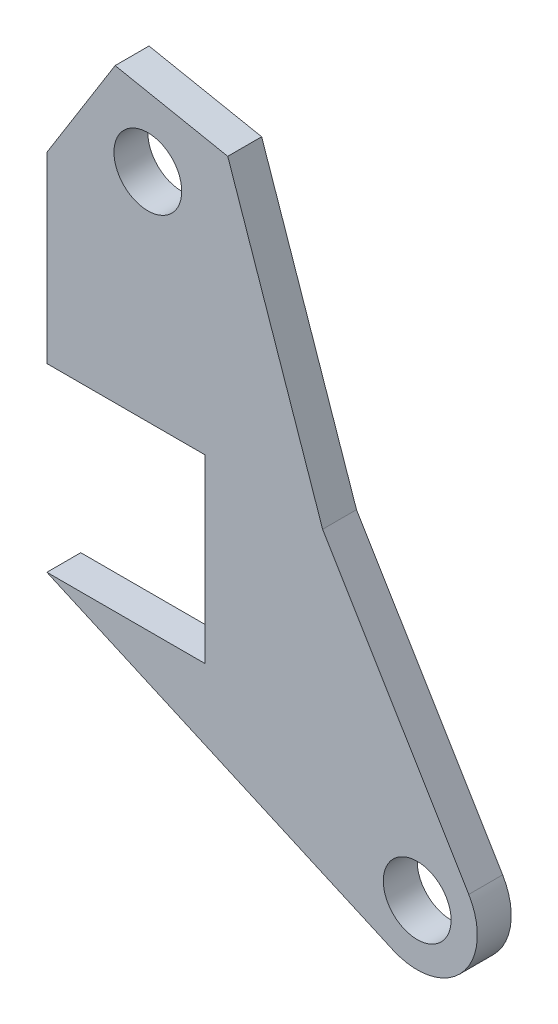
from build123d import *

# Parameters (mm, degrees)
ESQUISSE1_R      = 15
EXTRUSION1_DEPTH = 15


with BuildPart() as part:
    # Esquisse1 → Extrusion1 (new body)
    with BuildSketch(Plane.XY):
        with BuildLine():
            Line((0, 0), (0, 81))
            Line((0, 81), (30.205398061, 129.338741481))
            Line((30.205398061, 129.338741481), (80.05716767, 119.479395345))
            Line((80.05716767, 119.479395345), (122.055459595, -2.492500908))
            Line((122.055459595, -2.492500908), (186.731383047, -110.131313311))
            ThreePointArc((186.731383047, -110.131313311), (183.850889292, -141.479500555), (153.087410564, -148.158906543))
            Line((153.087410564, -148.158906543), (0, -80))
            Line((0, -80), (70, -80))
            Line((70, -80), (70, 0))
            Line((70, 0), (0, 0))
        make_face()
        with Locations((44.682456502, 95.894480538)):
            Circle(ESQUISSE1_R, mode=Mode.SUBTRACT)
        with Locations((163.914369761, -123.841158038)):
            Circle(ESQUISSE1_R, mode=Mode.SUBTRACT)
    extrude(amount=EXTRUSION1_DEPTH)


solid = part.part
